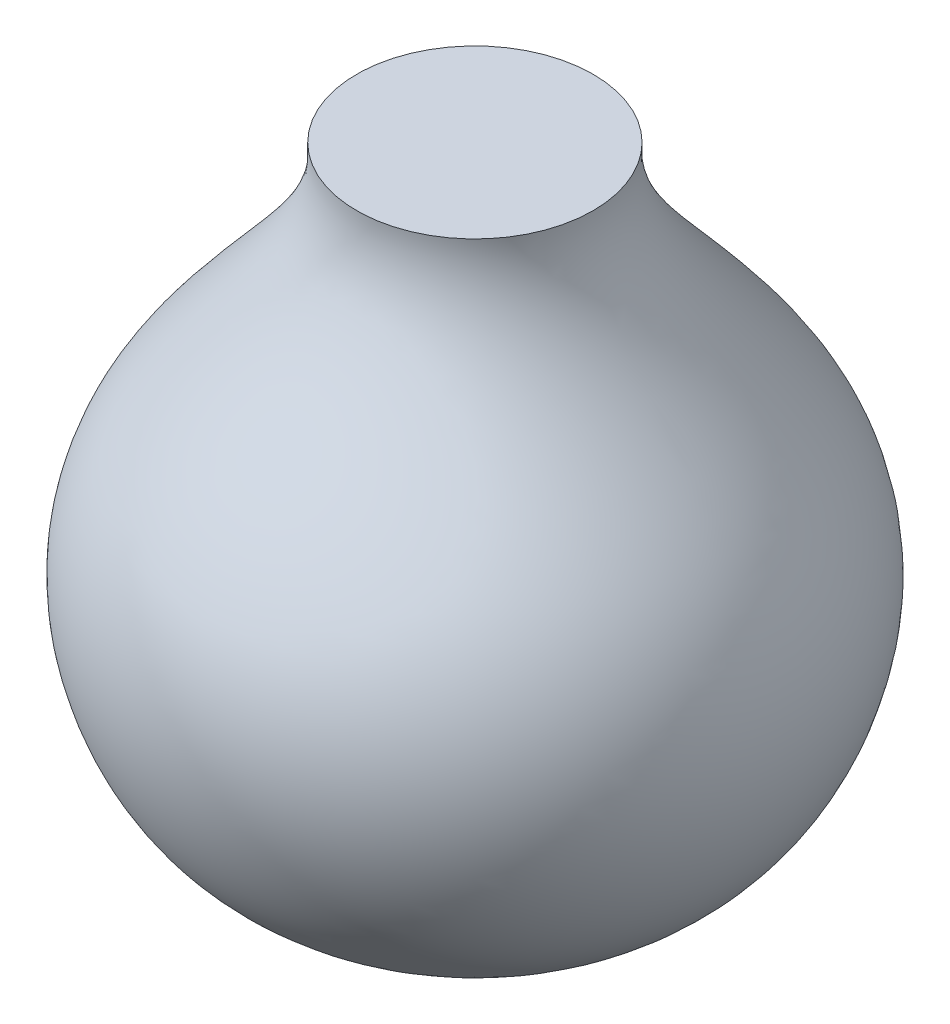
ISO-10303-21;
HEADER;
FILE_DESCRIPTION(('STEP AP214'),'2;1');
FILE_NAME('part.step','',(''),(''),'','','');
FILE_SCHEMA(('AUTOMOTIVE_DESIGN { 1 0 10303 214 1 1 1 1 }'));
ENDSEC;
DATA;
#1=APPLICATION_CONTEXT('core data for automotive mechanical design processes');
#2=APPLICATION_PROTOCOL_DEFINITION('international standard','automotive_design',2000,#1);
#3=PRODUCT_CONTEXT('',#1,'mechanical');
#4=PRODUCT('Part','Part','',(#3));
#5=PRODUCT_RELATED_PRODUCT_CATEGORY('part','',(#4));
#6=PRODUCT_DEFINITION_FORMATION('','',#4);
#7=PRODUCT_DEFINITION_CONTEXT('part definition',#1,'design');
#8=PRODUCT_DEFINITION('design','',#6,#7);
#9=PRODUCT_DEFINITION_SHAPE('','',#8);
#10=(LENGTH_UNIT() NAMED_UNIT(*) SI_UNIT(.MILLI.,.METRE.));
#11=(NAMED_UNIT(*) PLANE_ANGLE_UNIT() SI_UNIT($,.RADIAN.));
#12=(NAMED_UNIT(*) SI_UNIT($,.STERADIAN.) SOLID_ANGLE_UNIT());
#13=UNCERTAINTY_MEASURE_WITH_UNIT(LENGTH_MEASURE(1.E-05),#10,'distance_accuracy_value','');
#14=(GEOMETRIC_REPRESENTATION_CONTEXT(3) GLOBAL_UNCERTAINTY_ASSIGNED_CONTEXT((#13)) GLOBAL_UNIT_ASSIGNED_CONTEXT((#10,
#11,#12)) REPRESENTATION_CONTEXT('',''));
#15=CARTESIAN_POINT('',(0.,0.,0.));
#16=DIRECTION('',(0.,0.,1.));
#17=DIRECTION('',(1.,0.,0.));
#18=AXIS2_PLACEMENT_3D('',#15,#16,#17);
#19=CARTESIAN_POINT('',(0.,0.,0.));
#20=CARTESIAN_POINT('',(13.8871801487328,0.,0.));
#21=CARTESIAN_POINT('',(24.7881747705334,6.85908766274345,0.));
#22=CARTESIAN_POINT('',(32.0384031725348,25.38979208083,0.));
#23=CARTESIAN_POINT('',(29.0632046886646,43.5951288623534,0.));
#24=CARTESIAN_POINT('',(11.2484672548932,55.7709297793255,0.));
#25=CARTESIAN_POINT('',(12.,65.,0.));
#26=B_SPLINE_CURVE_WITH_KNOTS('',3,(#19,#20,#21,#22,#23,#24,#25),.UNSPECIFIED.,.F.,.F.,(4,1,1,1,
4),(0.,0.328628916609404,0.396262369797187,0.645215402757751,1.),.UNSPECIFIED.);
#27=CARTESIAN_POINT('',(0.,0.,0.));
#28=DIRECTION('',(0.,-1.,0.));
#29=AXIS1_PLACEMENT('',#27,#28);
#30=SURFACE_OF_REVOLUTION('',#26,#29);
#31=CARTESIAN_POINT('',(0.,65.,0.));
#32=DIRECTION('',(0.,-1.,0.));
#33=DIRECTION('',(0.,0.,-1.));
#34=AXIS2_PLACEMENT_3D('',#31,#32,#33);
#35=CIRCLE('',#34,12.);
#36=CARTESIAN_POINT('',(0.,65.,-12.));
#37=VERTEX_POINT('',#36);
#38=EDGE_CURVE('E11',#37,#37,#35,.T.);
#39=ORIENTED_EDGE('',*,*,#38,.T.);
#40=EDGE_LOOP('',(#39));
#41=FACE_BOUND('',#40,.T.);
#42=CARTESIAN_POINT('',(0.,0.,0.));
#43=VERTEX_POINT('',#42);
#44=VERTEX_LOOP('',#43);
#45=FACE_BOUND('',#44,.T.);
#46=ADVANCED_FACE('F43',(#41,#45),#30,.F.);
#47=CARTESIAN_POINT('',(12.,65.,0.));
#48=DIRECTION('',(0.,1.,0.));
#49=DIRECTION('',(0.,0.,1.));
#50=AXIS2_PLACEMENT_3D('',#47,#48,#49);
#51=PLANE('',#50);
#52=ORIENTED_EDGE('',*,*,#38,.F.);
#53=EDGE_LOOP('',(#52));
#54=FACE_BOUND('',#53,.T.);
#55=ADVANCED_FACE('F53',(#54),#51,.T.);
#56=CLOSED_SHELL('',(#46,#55));
#57=MANIFOLD_SOLID_BREP('B2',#56);
#58=ADVANCED_BREP_SHAPE_REPRESENTATION('',(#18,#57),#14);
#59=SHAPE_DEFINITION_REPRESENTATION(#9,#58);
ENDSEC;
END-ISO-10303-21;
